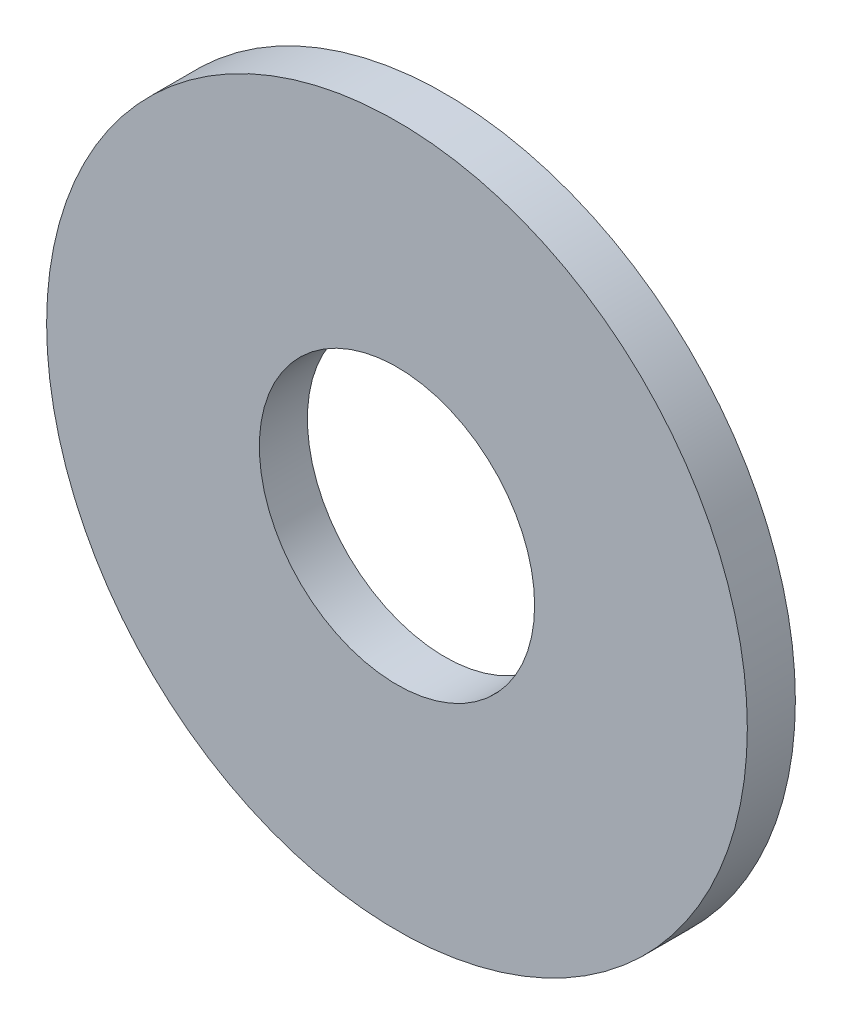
from build123d import *

# Parameters (mm, degrees)
SKETCH1_R      = 22.225
SKETCH1_R_2    = 8.73125
EXTRUDE1_DEPTH = 3.048


with BuildPart() as part:
    # Sketch1 → Extrude1 (new body)
    with BuildSketch(Plane.XY):
        Circle(SKETCH1_R)
        Circle(SKETCH1_R_2, mode=Mode.SUBTRACT)
    extrude(amount=-EXTRUDE1_DEPTH)


solid = part.part
